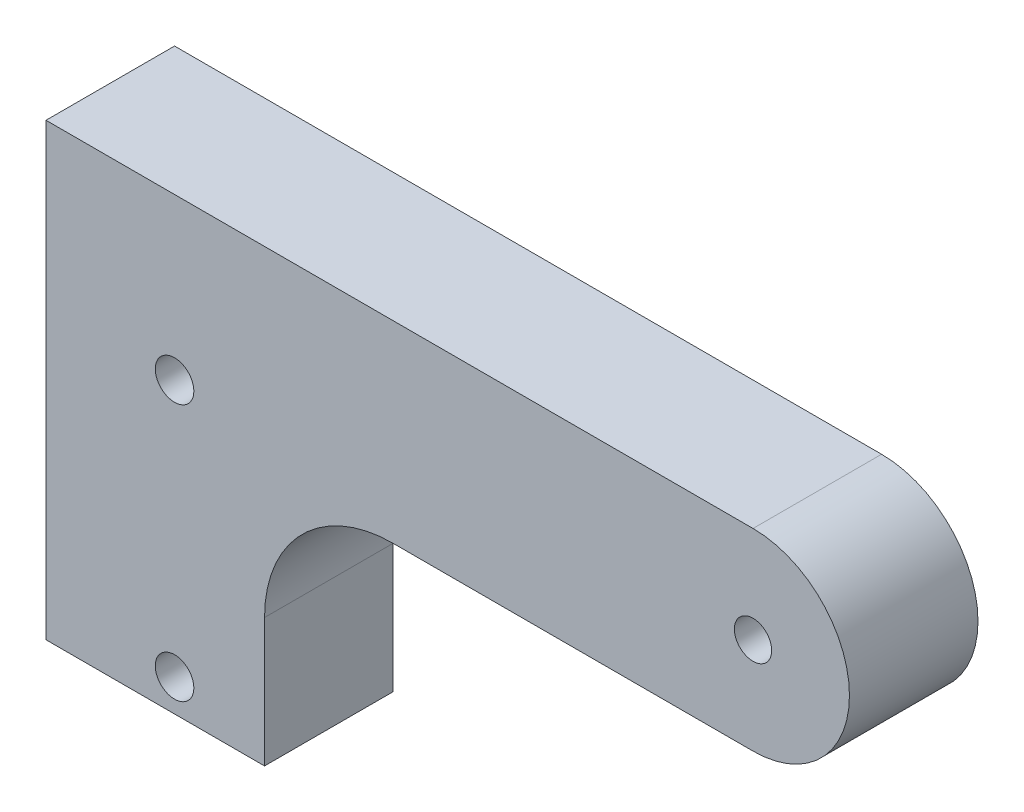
from build123d import *

# Parameters (mm, degrees)
SKETCH_1_R          = 1.45
EXTRUDE_1_DEPTH     = 10
SKETCH_2_R          = 1.5
CUT_EXTRUDE_1_DEPTH = 10


with BuildPart() as part:
    # Sketch 1 → Extrude 1 (new body)
    with BuildSketch(Plane.XY):
        with BuildLine():
            Line((-25.525285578, -15.279095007), (-25.525285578, -25.279095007))
            Line((-25.525285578, -25.279095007), (-42.525285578, -25.279095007))
            Line((-42.525285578, -25.279095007), (-42.525285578, 9.720904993))
            Line((-42.525285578, 9.720904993), (12.474714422, 9.720904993))
            ThreePointArc((12.474714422, 9.720904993), (19.974714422, 2.220904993), (12.474714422, -5.279095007))
            Line((12.474714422, -5.279095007), (-15.525285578, -5.279095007))
            ThreePointArc((-15.525285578, -5.279095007), (-22.59635339, -8.208027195), (-25.525285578, -15.279095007))
        make_face()
        with Locations((12.474714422, 2.220904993)):
            Circle(SKETCH_1_R, mode=Mode.SUBTRACT)
    extrude(amount=EXTRUDE_1_DEPTH)

    # Sketch 2 → Cut-Extrude 1 (cut)
    with BuildSketch(Plane.XY.offset(10)):
        with Locations((-32.525285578, -2.779095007)):
            Circle(SKETCH_2_R)
        with Locations((-32.525285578, -22.779095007)):
            Circle(SKETCH_2_R)
    extrude(amount=-CUT_EXTRUDE_1_DEPTH, mode=Mode.SUBTRACT)


solid = part.part
